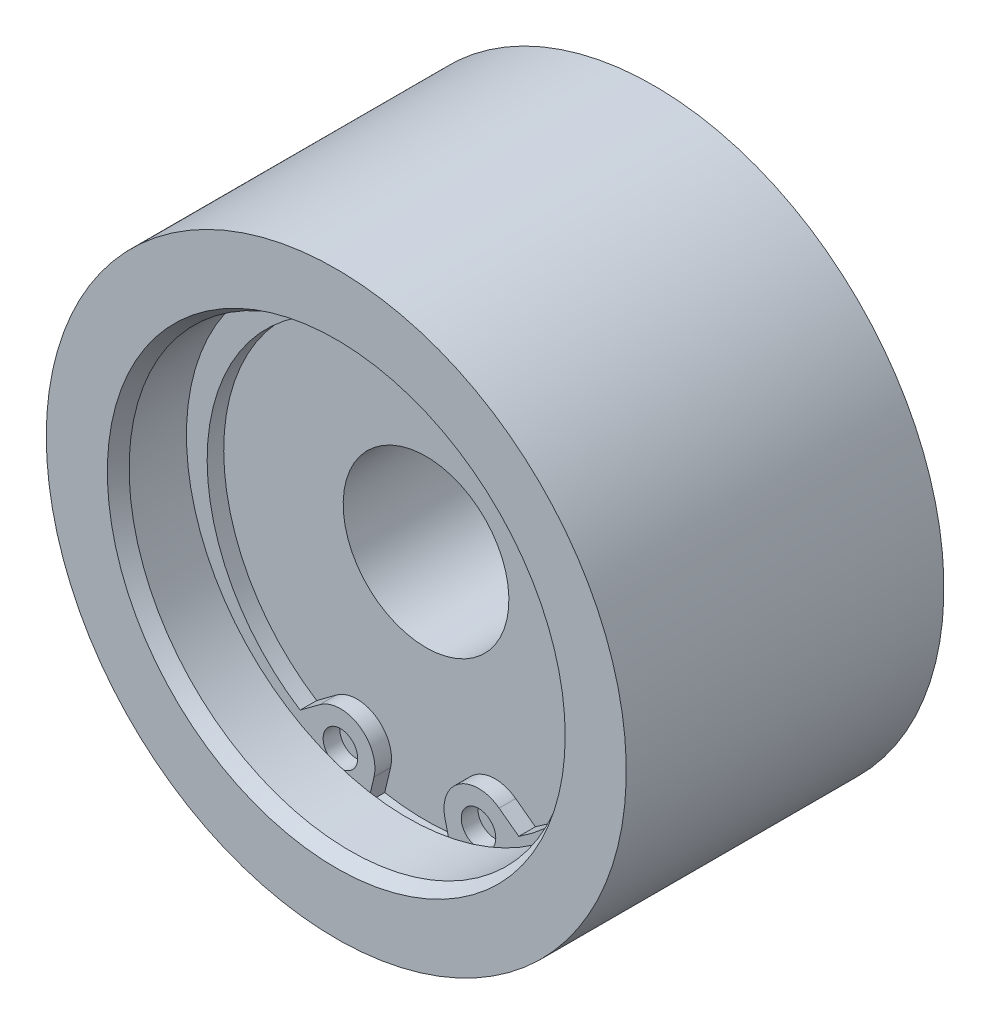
ISO-10303-21;
HEADER;
FILE_DESCRIPTION(('STEP AP214'),'2;1');
FILE_NAME('part.step','',(''),(''),'','','');
FILE_SCHEMA(('AUTOMOTIVE_DESIGN { 1 0 10303 214 1 1 1 1 }'));
ENDSEC;
DATA;
#1=APPLICATION_CONTEXT('core data for automotive mechanical design processes');
#2=APPLICATION_PROTOCOL_DEFINITION('international standard','automotive_design',2000,#1);
#3=PRODUCT_CONTEXT('',#1,'mechanical');
#4=PRODUCT('Part','Part','',(#3));
#5=PRODUCT_RELATED_PRODUCT_CATEGORY('part','',(#4));
#6=PRODUCT_DEFINITION_FORMATION('','',#4);
#7=PRODUCT_DEFINITION_CONTEXT('part definition',#1,'design');
#8=PRODUCT_DEFINITION('design','',#6,#7);
#9=PRODUCT_DEFINITION_SHAPE('','',#8);
#10=(LENGTH_UNIT() NAMED_UNIT(*) SI_UNIT(.MILLI.,.METRE.));
#11=(NAMED_UNIT(*) PLANE_ANGLE_UNIT() SI_UNIT($,.RADIAN.));
#12=(NAMED_UNIT(*) SI_UNIT($,.STERADIAN.) SOLID_ANGLE_UNIT());
#13=UNCERTAINTY_MEASURE_WITH_UNIT(LENGTH_MEASURE(1.E-05),#10,'distance_accuracy_value','');
#14=(GEOMETRIC_REPRESENTATION_CONTEXT(3) GLOBAL_UNCERTAINTY_ASSIGNED_CONTEXT((#13)) GLOBAL_UNIT_ASSIGNED_CONTEXT((#10,
#11,#12)) REPRESENTATION_CONTEXT('',''));
#15=CARTESIAN_POINT('',(0.,0.,0.));
#16=DIRECTION('',(0.,0.,1.));
#17=DIRECTION('',(1.,0.,0.));
#18=AXIS2_PLACEMENT_3D('',#15,#16,#17);
#19=CARTESIAN_POINT('',(0.,0.,-6.1));
#20=DIRECTION('',(0.,0.,1.));
#21=DIRECTION('',(1.,0.,0.));
#22=AXIS2_PLACEMENT_3D('',#19,#20,#21);
#23=CYLINDRICAL_SURFACE('',#22,21.);
#24=CARTESIAN_POINT('',(0.,0.,11.5));
#25=DIRECTION('',(0.,0.,-1.));
#26=DIRECTION('',(-1.,0.,0.));
#27=AXIS2_PLACEMENT_3D('',#24,#25,#26);
#28=CIRCLE('',#27,21.);
#29=CARTESIAN_POINT('',(-21.,0.,11.5));
#30=VERTEX_POINT('',#29);
#31=EDGE_CURVE('E163',#30,#30,#28,.T.);
#32=ORIENTED_EDGE('',*,*,#31,.T.);
#33=EDGE_LOOP('',(#32));
#34=FACE_BOUND('',#33,.T.);
#35=CARTESIAN_POINT('',(0.,0.,-11.5));
#36=DIRECTION('',(0.,0.,-1.));
#37=DIRECTION('',(-1.,0.,0.));
#38=AXIS2_PLACEMENT_3D('',#35,#36,#37);
#39=CIRCLE('',#38,21.);
#40=CARTESIAN_POINT('',(-21.,0.,-11.5));
#41=VERTEX_POINT('',#40);
#42=EDGE_CURVE('E155',#41,#41,#39,.T.);
#43=ORIENTED_EDGE('',*,*,#42,.F.);
#44=EDGE_LOOP('',(#43));
#45=FACE_BOUND('',#44,.T.);
#46=ADVANCED_FACE('F14',(#34,#45),#23,.T.);
#47=CARTESIAN_POINT('',(-30.36,-30.464467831,-11.5));
#48=DIRECTION('',(0.,0.,1.));
#49=DIRECTION('',(1.,0.,0.));
#50=AXIS2_PLACEMENT_3D('',#47,#48,#49);
#51=PLANE('',#50);
#52=CARTESIAN_POINT('',(0.,0.,-11.5));
#53=DIRECTION('',(0.,0.,1.));
#54=DIRECTION('',(1.,0.,0.));
#55=AXIS2_PLACEMENT_3D('',#52,#53,#54);
#56=CIRCLE('',#55,13.);
#57=CARTESIAN_POINT('',(13.,0.,-11.5));
#58=VERTEX_POINT('',#57);
#59=EDGE_CURVE('E192',#58,#58,#56,.F.);
#60=ORIENTED_EDGE('',*,*,#59,.F.);
#61=EDGE_LOOP('',(#60));
#62=FACE_BOUND('',#61,.T.);
#63=ORIENTED_EDGE('',*,*,#42,.T.);
#64=EDGE_LOOP('',(#63));
#65=FACE_BOUND('',#64,.T.);
#66=ADVANCED_FACE('F247',(#62,#65),#51,.F.);
#67=CARTESIAN_POINT('',(30.36,-30.464467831,11.5));
#68=DIRECTION('',(0.,0.,-1.));
#69=DIRECTION('',(-1.,0.,0.));
#70=AXIS2_PLACEMENT_3D('',#67,#68,#69);
#71=PLANE('',#70);
#72=CARTESIAN_POINT('',(0.,0.,11.5));
#73=DIRECTION('',(0.,0.,1.));
#74=DIRECTION('',(1.,0.,0.));
#75=AXIS2_PLACEMENT_3D('',#72,#73,#74);
#76=CIRCLE('',#75,16.577350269);
#77=CARTESIAN_POINT('',(16.577350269,0.,11.5));
#78=VERTEX_POINT('',#77);
#79=EDGE_CURVE('E174',#78,#78,#76,.T.);
#80=ORIENTED_EDGE('',*,*,#79,.F.);
#81=EDGE_LOOP('',(#80));
#82=FACE_BOUND('',#81,.T.);
#83=ORIENTED_EDGE('',*,*,#31,.F.);
#84=EDGE_LOOP('',(#83));
#85=FACE_BOUND('',#84,.T.);
#86=ADVANCED_FACE('F253',(#82,#85),#71,.F.);
#87=CARTESIAN_POINT('',(0.,0.,-11.5));
#88=DIRECTION('',(0.,0.,1.));
#89=DIRECTION('',(1.,0.,0.));
#90=AXIS2_PLACEMENT_3D('',#87,#88,#89);
#91=CYLINDRICAL_SURFACE('',#90,13.);
#92=ORIENTED_EDGE('',*,*,#59,.T.);
#93=EDGE_LOOP('',(#92));
#94=FACE_BOUND('',#93,.T.);
#95=CARTESIAN_POINT('',(0.,0.,-5.));
#96=DIRECTION('',(0.,0.,1.));
#97=DIRECTION('',(1.,0.,0.));
#98=AXIS2_PLACEMENT_3D('',#95,#96,#97);
#99=CIRCLE('',#98,13.);
#100=CARTESIAN_POINT('',(13.,0.,-5.));
#101=VERTEX_POINT('',#100);
#102=EDGE_CURVE('E168',#101,#101,#99,.T.);
#103=ORIENTED_EDGE('',*,*,#102,.T.);
#104=EDGE_LOOP('',(#103));
#105=FACE_BOUND('',#104,.T.);
#106=ADVANCED_FACE('F270',(#94,#105),#91,.F.);
#107=CARTESIAN_POINT('',(0.,0.,10.5));
#108=DIRECTION('',(0.,0.,1.));
#109=DIRECTION('',(1.,0.,0.));
#110=AXIS2_PLACEMENT_3D('',#107,#108,#109);
#111=CONICAL_SURFACE('',#110,16.,0.523598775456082);
#112=CARTESIAN_POINT('',(0.,0.,10.5));
#113=DIRECTION('',(0.,0.,1.));
#114=DIRECTION('',(1.,0.,0.));
#115=AXIS2_PLACEMENT_3D('',#112,#113,#114);
#116=CIRCLE('',#115,16.);
#117=CARTESIAN_POINT('',(16.,0.,10.5));
#118=VERTEX_POINT('',#117);
#119=EDGE_CURVE('E171',#118,#118,#116,.T.);
#120=ORIENTED_EDGE('',*,*,#119,.F.);
#121=EDGE_LOOP('',(#120));
#122=FACE_BOUND('',#121,.T.);
#123=ORIENTED_EDGE('',*,*,#79,.T.);
#124=EDGE_LOOP('',(#123));
#125=FACE_BOUND('',#124,.T.);
#126=ADVANCED_FACE('F267',(#122,#125),#111,.F.);
#127=CARTESIAN_POINT('',(-13.156,-13.201269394,-5.));
#128=DIRECTION('',(0.,0.,1.));
#129=DIRECTION('',(1.,0.,0.));
#130=AXIS2_PLACEMENT_3D('',#127,#128,#129);
#131=PLANE('',#130);
#132=CARTESIAN_POINT('',(0.,0.,-5.));
#133=DIRECTION('',(0.,0.,1.));
#134=DIRECTION('',(0.,-1.,0.));
#135=AXIS2_PLACEMENT_3D('',#132,#133,#134);
#136=CIRCLE('',#135,6.);
#137=CARTESIAN_POINT('',(0.,-6.,-5.));
#138=VERTEX_POINT('',#137);
#139=EDGE_CURVE('E189',#138,#138,#136,.T.);
#140=ORIENTED_EDGE('',*,*,#139,.T.);
#141=EDGE_LOOP('',(#140));
#142=FACE_BOUND('',#141,.T.);
#143=ORIENTED_EDGE('',*,*,#102,.F.);
#144=EDGE_LOOP('',(#143));
#145=FACE_BOUND('',#144,.T.);
#146=ADVANCED_FACE('F265',(#142,#145),#131,.F.);
#147=CARTESIAN_POINT('',(0.,0.,6.35));
#148=DIRECTION('',(0.,0.,1.));
#149=DIRECTION('',(1.,0.,0.));
#150=AXIS2_PLACEMENT_3D('',#147,#148,#149);
#151=CYLINDRICAL_SURFACE('',#150,16.);
#152=CARTESIAN_POINT('',(0.,0.,6.35));
#153=DIRECTION('',(0.,0.,1.));
#154=DIRECTION('',(1.,0.,0.));
#155=AXIS2_PLACEMENT_3D('',#152,#153,#154);
#156=CIRCLE('',#155,16.);
#157=CARTESIAN_POINT('',(16.,0.,6.35));
#158=VERTEX_POINT('',#157);
#159=EDGE_CURVE('E175',#158,#158,#156,.T.);
#160=ORIENTED_EDGE('',*,*,#159,.F.);
#161=EDGE_LOOP('',(#160));
#162=FACE_BOUND('',#161,.T.);
#163=ORIENTED_EDGE('',*,*,#119,.T.);
#164=EDGE_LOOP('',(#163));
#165=FACE_BOUND('',#164,.T.);
#166=ADVANCED_FACE('F261',(#162,#165),#151,.F.);
#167=CARTESIAN_POINT('',(0.,0.,-5.));
#168=DIRECTION('',(0.,0.,1.));
#169=DIRECTION('',(0.,-1.,0.));
#170=AXIS2_PLACEMENT_3D('',#167,#168,#169);
#171=CYLINDRICAL_SURFACE('',#170,6.);
#172=ORIENTED_EDGE('',*,*,#139,.F.);
#173=EDGE_LOOP('',(#172));
#174=FACE_BOUND('',#173,.T.);
#175=CARTESIAN_POINT('',(0.,0.,5.));
#176=DIRECTION('',(0.,0.,1.));
#177=DIRECTION('',(0.,-1.,0.));
#178=AXIS2_PLACEMENT_3D('',#175,#176,#177);
#179=CIRCLE('',#178,6.);
#180=CARTESIAN_POINT('',(0.,-6.,5.));
#181=VERTEX_POINT('',#180);
#182=EDGE_CURVE('E186',#181,#181,#179,.T.);
#183=ORIENTED_EDGE('',*,*,#182,.T.);
#184=EDGE_LOOP('',(#183));
#185=FACE_BOUND('',#184,.T.);
#186=ADVANCED_FACE('F264',(#174,#185),#171,.F.);
#187=CARTESIAN_POINT('',(17.0522,-17.110876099,5.));
#188=DIRECTION('',(0.,0.,-1.));
#189=DIRECTION('',(-1.,0.,0.));
#190=AXIS2_PLACEMENT_3D('',#187,#188,#189);
#191=PLANE('',#190);
#192=ORIENTED_EDGE('',*,*,#182,.F.);
#193=EDGE_LOOP('',(#192));
#194=FACE_BOUND('',#193,.T.);
#195=DIRECTION('',(0.231349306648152,-0.972870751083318,0.));
#196=VECTOR('',#195,1.);
#197=CARTESIAN_POINT('',(3.86278507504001,-20.2473276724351,5.));
#198=LINE('',#197,#196);
#199=CARTESIAN_POINT('',(2.56782312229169,-14.8017500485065,5.));
#200=VERTEX_POINT('',#199);
#201=CARTESIAN_POINT('',(2.99125499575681,-16.5823669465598,5.));
#202=VERTEX_POINT('',#201);
#203=EDGE_CURVE('E9',#200,#202,#198,.T.);
#204=ORIENTED_EDGE('',*,*,#203,.F.);
#205=CARTESIAN_POINT('',(5.,-14.2233767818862,5.));
#206=DIRECTION('',(0.,0.,-1.));
#207=DIRECTION('',(-1.,0.,0.));
#208=AXIS2_PLACEMENT_3D('',#205,#206,#207);
#209=CIRCLE('',#208,2.5);
#210=CARTESIAN_POINT('',(6.49138441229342,-12.2169439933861,5.));
#211=VERTEX_POINT('',#210);
#212=EDGE_CURVE('E25',#200,#211,#209,.T.);
#213=ORIENTED_EDGE('',*,*,#212,.T.);
#214=DIRECTION('',(-0.802573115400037,0.596553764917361,0.));
#215=VECTOR('',#214,1.);
#216=CARTESIAN_POINT('',(15.6369621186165,-19.0148652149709,5.));
#217=LINE('',#216,#215);
#218=CARTESIAN_POINT('',(7.91695293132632,-13.2765711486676,5.));
#219=VERTEX_POINT('',#218);
#220=EDGE_CURVE('E73',#219,#211,#217,.T.);
#221=ORIENTED_EDGE('',*,*,#220,.F.);
#222=CARTESIAN_POINT('',(0.,-0.95,5.));
#223=DIRECTION('',(0.,0.,-1.));
#224=DIRECTION('',(-1.,0.,0.));
#225=AXIS2_PLACEMENT_3D('',#222,#223,#224);
#226=CIRCLE('',#225,14.65);
#227=CARTESIAN_POINT('',(-7.91695293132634,-13.2765711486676,5.));
#228=VERTEX_POINT('',#227);
#229=EDGE_CURVE('E223',#228,#219,#226,.T.);
#230=ORIENTED_EDGE('',*,*,#229,.F.);
#231=DIRECTION('',(-0.802573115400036,-0.596553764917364,0.));
#232=VECTOR('',#231,1.);
#233=CARTESIAN_POINT('',(6.33048697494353,-2.68642832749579,5.));
#234=LINE('',#233,#232);
#235=CARTESIAN_POINT('',(-6.49138441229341,-12.2169439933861,5.));
#236=VERTEX_POINT('',#235);
#237=EDGE_CURVE('E220',#236,#228,#234,.T.);
#238=ORIENTED_EDGE('',*,*,#237,.F.);
#239=CARTESIAN_POINT('',(-5.,-14.2233767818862,5.));
#240=DIRECTION('',(0.,0.,-1.));
#241=DIRECTION('',(-1.,0.,0.));
#242=AXIS2_PLACEMENT_3D('',#239,#240,#241);
#243=CIRCLE('',#242,2.5);
#244=CARTESIAN_POINT('',(-2.56782312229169,-14.8017500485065,5.));
#245=VERTEX_POINT('',#244);
#246=EDGE_CURVE('E213',#236,#245,#243,.T.);
#247=ORIENTED_EDGE('',*,*,#246,.T.);
#248=DIRECTION('',(0.231349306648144,0.97287075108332,0.));
#249=VECTOR('',#248,1.);
#250=CARTESIAN_POINT('',(-2.03743226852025,-12.5713489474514,5.));
#251=LINE('',#250,#249);
#252=CARTESIAN_POINT('',(-2.9912549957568,-16.5823669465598,5.));
#253=VERTEX_POINT('',#252);
#254=EDGE_CURVE('E217',#253,#245,#251,.T.);
#255=ORIENTED_EDGE('',*,*,#254,.F.);
#256=CARTESIAN_POINT('',(0.,0.,5.));
#257=DIRECTION('',(0.,0.,1.));
#258=DIRECTION('',(1.,0.,0.));
#259=AXIS2_PLACEMENT_3D('',#256,#257,#258);
#260=CIRCLE('',#259,16.85);
#261=EDGE_CURVE('E184',#253,#202,#260,.T.);
#262=ORIENTED_EDGE('',*,*,#261,.T.);
#263=EDGE_LOOP('',(#204,#213,#221,#230,#238,#247,#255,#262));
#264=FACE_BOUND('',#263,.T.);
#265=ADVANCED_FACE('F230',(#194,#264),#191,.F.);
#266=CARTESIAN_POINT('',(-17.0522,-17.110876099,6.35));
#267=DIRECTION('',(0.,0.,1.));
#268=DIRECTION('',(1.,0.,0.));
#269=AXIS2_PLACEMENT_3D('',#266,#267,#268);
#270=PLANE('',#269);
#271=ORIENTED_EDGE('',*,*,#159,.T.);
#272=EDGE_LOOP('',(#271));
#273=FACE_BOUND('',#272,.T.);
#274=CARTESIAN_POINT('',(0.,0.,6.35));
#275=DIRECTION('',(0.,0.,1.));
#276=DIRECTION('',(1.,0.,0.));
#277=AXIS2_PLACEMENT_3D('',#274,#275,#276);
#278=CIRCLE('',#277,16.85);
#279=CARTESIAN_POINT('',(16.85,0.,6.35));
#280=VERTEX_POINT('',#279);
#281=EDGE_CURVE('E181',#280,#280,#278,.T.);
#282=ORIENTED_EDGE('',*,*,#281,.F.);
#283=EDGE_LOOP('',(#282));
#284=FACE_BOUND('',#283,.T.);
#285=ADVANCED_FACE('F277',(#273,#284),#270,.F.);
#286=CARTESIAN_POINT('',(0.,0.,5.));
#287=DIRECTION('',(0.,0.,1.));
#288=DIRECTION('',(1.,0.,0.));
#289=AXIS2_PLACEMENT_3D('',#286,#287,#288);
#290=CYLINDRICAL_SURFACE('',#289,16.85);
#291=ORIENTED_EDGE('',*,*,#281,.T.);
#292=EDGE_LOOP('',(#291));
#293=FACE_BOUND('',#292,.T.);
#294=CARTESIAN_POINT('',(0.,0.,6.2));
#295=DIRECTION('',(0.,0.,-1.));
#296=DIRECTION('',(-1.,0.,0.));
#297=AXIS2_PLACEMENT_3D('',#294,#295,#296);
#298=CIRCLE('',#297,16.85);
#299=CARTESIAN_POINT('',(-2.99125499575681,-16.5823669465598,6.2));
#300=VERTEX_POINT('',#299);
#301=CARTESIAN_POINT('',(2.99125499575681,-16.5823669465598,6.2));
#302=VERTEX_POINT('',#301);
#303=EDGE_CURVE('E199',#300,#302,#298,.T.);
#304=ORIENTED_EDGE('',*,*,#303,.T.);
#305=DIRECTION('',(0.,0.,1.));
#306=VECTOR('',#305,1.);
#307=CARTESIAN_POINT('',(2.99125499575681,-16.5823669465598,5.));
#308=LINE('',#307,#306);
#309=EDGE_CURVE('E202',#302,#202,#308,.F.);
#310=ORIENTED_EDGE('',*,*,#309,.T.);
#311=ORIENTED_EDGE('',*,*,#261,.F.);
#312=DIRECTION('',(0.,0.,1.));
#313=VECTOR('',#312,1.);
#314=CARTESIAN_POINT('',(-2.99125499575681,-16.5823669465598,5.));
#315=LINE('',#314,#313);
#316=EDGE_CURVE('E178',#253,#300,#315,.T.);
#317=ORIENTED_EDGE('',*,*,#316,.T.);
#318=EDGE_LOOP('',(#304,#310,#311,#317));
#319=FACE_BOUND('',#318,.T.);
#320=ADVANCED_FACE('F259',(#293,#319),#290,.F.);
#321=CARTESIAN_POINT('',(5.,-14.2233767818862,5.));
#322=DIRECTION('',(0.,0.,-1.));
#323=DIRECTION('',(-1.,0.,0.));
#324=AXIS2_PLACEMENT_3D('',#321,#322,#323);
#325=CIRCLE('',#324,1.25);
#326=CARTESIAN_POINT('',(3.75,-14.2233767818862,5.));
#327=VERTEX_POINT('',#326);
#328=EDGE_CURVE('E205',#327,#327,#325,.T.);
#329=ORIENTED_EDGE('',*,*,#328,.F.);
#330=EDGE_LOOP('',(#329));
#331=FACE_BOUND('',#330,.T.);
#332=ADVANCED_FACE('F279',(#331),#191,.F.);
#333=CARTESIAN_POINT('',(-5.,-14.2233767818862,5.));
#334=DIRECTION('',(0.,0.,-1.));
#335=DIRECTION('',(-1.,0.,0.));
#336=AXIS2_PLACEMENT_3D('',#333,#334,#335);
#337=CIRCLE('',#336,1.25);
#338=CARTESIAN_POINT('',(-6.25,-14.2233767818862,5.));
#339=VERTEX_POINT('',#338);
#340=EDGE_CURVE('E209',#339,#339,#337,.T.);
#341=ORIENTED_EDGE('',*,*,#340,.F.);
#342=EDGE_LOOP('',(#341));
#343=FACE_BOUND('',#342,.T.);
#344=ADVANCED_FACE('F243',(#343),#191,.F.);
#345=CARTESIAN_POINT('',(6.49138441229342,-12.2169439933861,6.2));
#346=DIRECTION('',(-0.596553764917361,-0.802573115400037,0.));
#347=DIRECTION('',(-0.802573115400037,0.596553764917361,0.));
#348=AXIS2_PLACEMENT_3D('',#345,#346,#347);
#349=PLANE('',#348);
#350=ORIENTED_EDGE('',*,*,#220,.T.);
#351=DIRECTION('',(0.,0.,-1.));
#352=VECTOR('',#351,1.);
#353=CARTESIAN_POINT('',(6.49138441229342,-12.2169439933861,6.2));
#354=LINE('',#353,#352);
#355=CARTESIAN_POINT('',(6.49138441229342,-12.2169439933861,6.2));
#356=VERTEX_POINT('',#355);
#357=EDGE_CURVE('E67',#356,#211,#354,.T.);
#358=ORIENTED_EDGE('',*,*,#357,.F.);
#359=DIRECTION('',(-0.802573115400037,0.596553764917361,0.));
#360=VECTOR('',#359,1.);
#361=CARTESIAN_POINT('',(6.49138441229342,-12.2169439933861,6.2));
#362=LINE('',#361,#360);
#363=CARTESIAN_POINT('',(7.91695293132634,-13.2765711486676,6.2));
#364=VERTEX_POINT('',#363);
#365=EDGE_CURVE('E71',#364,#356,#362,.T.);
#366=ORIENTED_EDGE('',*,*,#365,.F.);
#367=DIRECTION('',(0.,0.,-1.));
#368=VECTOR('',#367,1.);
#369=CARTESIAN_POINT('',(7.91695293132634,-13.2765711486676,6.2));
#370=LINE('',#369,#368);
#371=EDGE_CURVE('E123',#364,#219,#370,.T.);
#372=ORIENTED_EDGE('',*,*,#371,.T.);
#373=EDGE_LOOP('',(#350,#358,#366,#372));
#374=FACE_BOUND('',#373,.T.);
#375=ADVANCED_FACE('F69',(#374),#349,.F.);
#376=CARTESIAN_POINT('',(0.,-0.95,6.2));
#377=DIRECTION('',(0.,0.,1.));
#378=DIRECTION('',(-1.,0.,0.));
#379=AXIS2_PLACEMENT_3D('',#376,#377,#378);
#380=CYLINDRICAL_SURFACE('',#379,14.65);
#381=ORIENTED_EDGE('',*,*,#229,.T.);
#382=ORIENTED_EDGE('',*,*,#371,.F.);
#383=CARTESIAN_POINT('',(0.,-0.95,6.2));
#384=DIRECTION('',(0.,0.,-1.));
#385=DIRECTION('',(0.,-1.,0.));
#386=AXIS2_PLACEMENT_3D('',#383,#384,#385);
#387=CIRCLE('',#386,14.65);
#388=CARTESIAN_POINT('',(-7.91695293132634,-13.2765711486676,6.2));
#389=VERTEX_POINT('',#388);
#390=EDGE_CURVE('E87',#389,#364,#387,.T.);
#391=ORIENTED_EDGE('',*,*,#390,.F.);
#392=DIRECTION('',(0.,0.,-1.));
#393=VECTOR('',#392,1.);
#394=CARTESIAN_POINT('',(-7.91695293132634,-13.2765711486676,6.2));
#395=LINE('',#394,#393);
#396=EDGE_CURVE('E125',#389,#228,#395,.T.);
#397=ORIENTED_EDGE('',*,*,#396,.T.);
#398=EDGE_LOOP('',(#381,#382,#391,#397));
#399=FACE_BOUND('',#398,.T.);
#400=ADVANCED_FACE('F233',(#399),#380,.F.);
#401=CARTESIAN_POINT('',(-6.49138441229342,-12.2169439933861,6.2));
#402=DIRECTION('',(0.596553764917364,-0.802573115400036,0.));
#403=DIRECTION('',(0.,0.,-1.));
#404=AXIS2_PLACEMENT_3D('',#401,#402,#403);
#405=PLANE('',#404);
#406=ORIENTED_EDGE('',*,*,#237,.T.);
#407=ORIENTED_EDGE('',*,*,#396,.F.);
#408=DIRECTION('',(-0.802573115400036,-0.596553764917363,0.));
#409=VECTOR('',#408,1.);
#410=CARTESIAN_POINT('',(-6.49138441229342,-12.2169439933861,6.2));
#411=LINE('',#410,#409);
#412=CARTESIAN_POINT('',(-6.49138441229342,-12.2169439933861,6.2));
#413=VERTEX_POINT('',#412);
#414=EDGE_CURVE('E126',#413,#389,#411,.T.);
#415=ORIENTED_EDGE('',*,*,#414,.F.);
#416=DIRECTION('',(0.,0.,-1.));
#417=VECTOR('',#416,1.);
#418=CARTESIAN_POINT('',(-6.49138441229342,-12.2169439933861,6.2));
#419=LINE('',#418,#417);
#420=EDGE_CURVE('E105',#413,#236,#419,.T.);
#421=ORIENTED_EDGE('',*,*,#420,.T.);
#422=EDGE_LOOP('',(#406,#407,#415,#421));
#423=FACE_BOUND('',#422,.T.);
#424=ADVANCED_FACE('F235',(#423),#405,.F.);
#425=CARTESIAN_POINT('',(-5.,-14.2233767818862,6.2));
#426=DIRECTION('',(0.,0.,1.));
#427=DIRECTION('',(-1.,0.,0.));
#428=AXIS2_PLACEMENT_3D('',#425,#426,#427);
#429=CYLINDRICAL_SURFACE('',#428,1.25);
#430=ORIENTED_EDGE('',*,*,#340,.T.);
#431=EDGE_LOOP('',(#430));
#432=FACE_BOUND('',#431,.T.);
#433=CARTESIAN_POINT('',(-5.,-14.2233767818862,6.2));
#434=DIRECTION('',(0.,0.,-1.));
#435=DIRECTION('',(1.,0.,0.));
#436=AXIS2_PLACEMENT_3D('',#433,#434,#435);
#437=CIRCLE('',#436,1.25);
#438=CARTESIAN_POINT('',(-3.75,-14.2233767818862,6.2));
#439=VERTEX_POINT('',#438);
#440=EDGE_CURVE('E77',#439,#439,#437,.T.);
#441=ORIENTED_EDGE('',*,*,#440,.F.);
#442=EDGE_LOOP('',(#441));
#443=FACE_BOUND('',#442,.T.);
#444=ADVANCED_FACE('F241',(#432,#443),#429,.F.);
#445=CARTESIAN_POINT('',(5.,-14.2233767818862,6.2));
#446=DIRECTION('',(0.,0.,1.));
#447=DIRECTION('',(-1.,0.,0.));
#448=AXIS2_PLACEMENT_3D('',#445,#446,#447);
#449=CYLINDRICAL_SURFACE('',#448,1.25);
#450=ORIENTED_EDGE('',*,*,#328,.T.);
#451=EDGE_LOOP('',(#450));
#452=FACE_BOUND('',#451,.T.);
#453=CARTESIAN_POINT('',(5.,-14.2233767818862,6.2));
#454=DIRECTION('',(0.,0.,1.));
#455=DIRECTION('',(1.,0.,0.));
#456=AXIS2_PLACEMENT_3D('',#453,#454,#455);
#457=CIRCLE('',#456,1.25);
#458=CARTESIAN_POINT('',(6.25,-14.2233767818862,6.2));
#459=VERTEX_POINT('',#458);
#460=EDGE_CURVE('E118',#459,#459,#457,.T.);
#461=ORIENTED_EDGE('',*,*,#460,.T.);
#462=EDGE_LOOP('',(#461));
#463=FACE_BOUND('',#462,.T.);
#464=ADVANCED_FACE('F287',(#452,#463),#449,.F.);
#465=CARTESIAN_POINT('',(5.,-14.2233767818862,6.2));
#466=DIRECTION('',(0.,0.,1.));
#467=DIRECTION('',(-1.,0.,0.));
#468=AXIS2_PLACEMENT_3D('',#465,#466,#467);
#469=CYLINDRICAL_SURFACE('',#468,2.5);
#470=ORIENTED_EDGE('',*,*,#212,.F.);
#471=DIRECTION('',(0.,0.,-1.));
#472=VECTOR('',#471,1.);
#473=CARTESIAN_POINT('',(2.5678231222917,-14.8017500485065,6.2));
#474=LINE('',#473,#472);
#475=CARTESIAN_POINT('',(2.5678231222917,-14.8017500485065,6.2));
#476=VERTEX_POINT('',#475);
#477=EDGE_CURVE('E78',#476,#200,#474,.T.);
#478=ORIENTED_EDGE('',*,*,#477,.F.);
#479=CARTESIAN_POINT('',(5.,-14.2233767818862,6.2));
#480=DIRECTION('',(0.,0.,1.));
#481=DIRECTION('',(1.,0.,0.));
#482=AXIS2_PLACEMENT_3D('',#479,#480,#481);
#483=CIRCLE('',#482,2.5);
#484=EDGE_CURVE('E18',#356,#476,#483,.T.);
#485=ORIENTED_EDGE('',*,*,#484,.F.);
#486=ORIENTED_EDGE('',*,*,#357,.T.);
#487=EDGE_LOOP('',(#470,#478,#485,#486));
#488=FACE_BOUND('',#487,.T.);
#489=ADVANCED_FACE('F16',(#488),#469,.T.);
#490=CARTESIAN_POINT('',(0.,-0.95,6.2));
#491=DIRECTION('',(0.,0.,-1.));
#492=DIRECTION('',(0.,-1.,0.));
#493=AXIS2_PLACEMENT_3D('',#490,#491,#492);
#494=PLANE('',#493);
#495=ORIENTED_EDGE('',*,*,#460,.F.);
#496=EDGE_LOOP('',(#495));
#497=FACE_BOUND('',#496,.T.);
#498=ORIENTED_EDGE('',*,*,#440,.T.);
#499=EDGE_LOOP('',(#498));
#500=FACE_BOUND('',#499,.T.);
#501=ORIENTED_EDGE('',*,*,#303,.F.);
#502=DIRECTION('',(0.231349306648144,0.97287075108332,0.));
#503=VECTOR('',#502,1.);
#504=CARTESIAN_POINT('',(-2.56782312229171,-14.8017500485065,6.2));
#505=LINE('',#504,#503);
#506=CARTESIAN_POINT('',(-2.56782312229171,-14.8017500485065,6.2));
#507=VERTEX_POINT('',#506);
#508=EDGE_CURVE('E96',#300,#507,#505,.T.);
#509=ORIENTED_EDGE('',*,*,#508,.T.);
#510=CARTESIAN_POINT('',(-5.,-14.2233767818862,6.2));
#511=DIRECTION('',(0.,0.,1.));
#512=DIRECTION('',(-1.,0.,0.));
#513=AXIS2_PLACEMENT_3D('',#510,#511,#512);
#514=CIRCLE('',#513,2.5);
#515=EDGE_CURVE('E102',#507,#413,#514,.T.);
#516=ORIENTED_EDGE('',*,*,#515,.T.);
#517=ORIENTED_EDGE('',*,*,#414,.T.);
#518=ORIENTED_EDGE('',*,*,#390,.T.);
#519=ORIENTED_EDGE('',*,*,#365,.T.);
#520=ORIENTED_EDGE('',*,*,#484,.T.);
#521=DIRECTION('',(0.231349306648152,-0.972870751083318,0.));
#522=VECTOR('',#521,1.);
#523=CARTESIAN_POINT('',(2.5678231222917,-14.8017500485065,6.2));
#524=LINE('',#523,#522);
#525=EDGE_CURVE('E93',#476,#302,#524,.T.);
#526=ORIENTED_EDGE('',*,*,#525,.T.);
#527=EDGE_LOOP('',(#501,#509,#516,#517,#518,#519,#520,#526));
#528=FACE_BOUND('',#527,.T.);
#529=ADVANCED_FACE('F83',(#497,#500,#528),#494,.F.);
#530=CARTESIAN_POINT('',(-5.,-14.2233767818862,6.2));
#531=DIRECTION('',(0.,0.,1.));
#532=DIRECTION('',(-1.,0.,0.));
#533=AXIS2_PLACEMENT_3D('',#530,#531,#532);
#534=CYLINDRICAL_SURFACE('',#533,2.5);
#535=ORIENTED_EDGE('',*,*,#246,.F.);
#536=ORIENTED_EDGE('',*,*,#420,.F.);
#537=ORIENTED_EDGE('',*,*,#515,.F.);
#538=DIRECTION('',(0.,0.,-1.));
#539=VECTOR('',#538,1.);
#540=CARTESIAN_POINT('',(-2.56782312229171,-14.8017500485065,6.2));
#541=LINE('',#540,#539);
#542=EDGE_CURVE('E122',#507,#245,#541,.T.);
#543=ORIENTED_EDGE('',*,*,#542,.T.);
#544=EDGE_LOOP('',(#535,#536,#537,#543));
#545=FACE_BOUND('',#544,.T.);
#546=ADVANCED_FACE('F289',(#545),#534,.T.);
#547=CARTESIAN_POINT('',(-2.56782312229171,-14.8017500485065,6.2));
#548=DIRECTION('',(-0.97287075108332,0.231349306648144,0.));
#549=DIRECTION('',(0.,0.,1.));
#550=AXIS2_PLACEMENT_3D('',#547,#548,#549);
#551=PLANE('',#550);
#552=ORIENTED_EDGE('',*,*,#316,.F.);
#553=ORIENTED_EDGE('',*,*,#254,.T.);
#554=ORIENTED_EDGE('',*,*,#542,.F.);
#555=ORIENTED_EDGE('',*,*,#508,.F.);
#556=EDGE_LOOP('',(#552,#553,#554,#555));
#557=FACE_BOUND('',#556,.T.);
#558=ADVANCED_FACE('F294',(#557),#551,.F.);
#559=CARTESIAN_POINT('',(2.5678231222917,-14.8017500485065,6.2));
#560=DIRECTION('',(0.972870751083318,0.231349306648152,0.));
#561=DIRECTION('',(0.,0.,-1.));
#562=AXIS2_PLACEMENT_3D('',#559,#560,#561);
#563=PLANE('',#562);
#564=ORIENTED_EDGE('',*,*,#309,.F.);
#565=ORIENTED_EDGE('',*,*,#525,.F.);
#566=ORIENTED_EDGE('',*,*,#477,.T.);
#567=ORIENTED_EDGE('',*,*,#203,.T.);
#568=EDGE_LOOP('',(#564,#565,#566,#567));
#569=FACE_BOUND('',#568,.T.);
#570=ADVANCED_FACE('F297',(#569),#563,.F.);
#571=CLOSED_SHELL('',(#46,#66,#86,#106,#126,#146,#166,#186,#265,#285,#320,#332,#344,#375,#400,
#424,#444,#464,#489,#529,#546,#558,#570));
#572=MANIFOLD_SOLID_BREP('B1',#571);
#573=ADVANCED_BREP_SHAPE_REPRESENTATION('',(#18,#572),#14);
#574=SHAPE_DEFINITION_REPRESENTATION(#9,#573);
ENDSEC;
END-ISO-10303-21;
